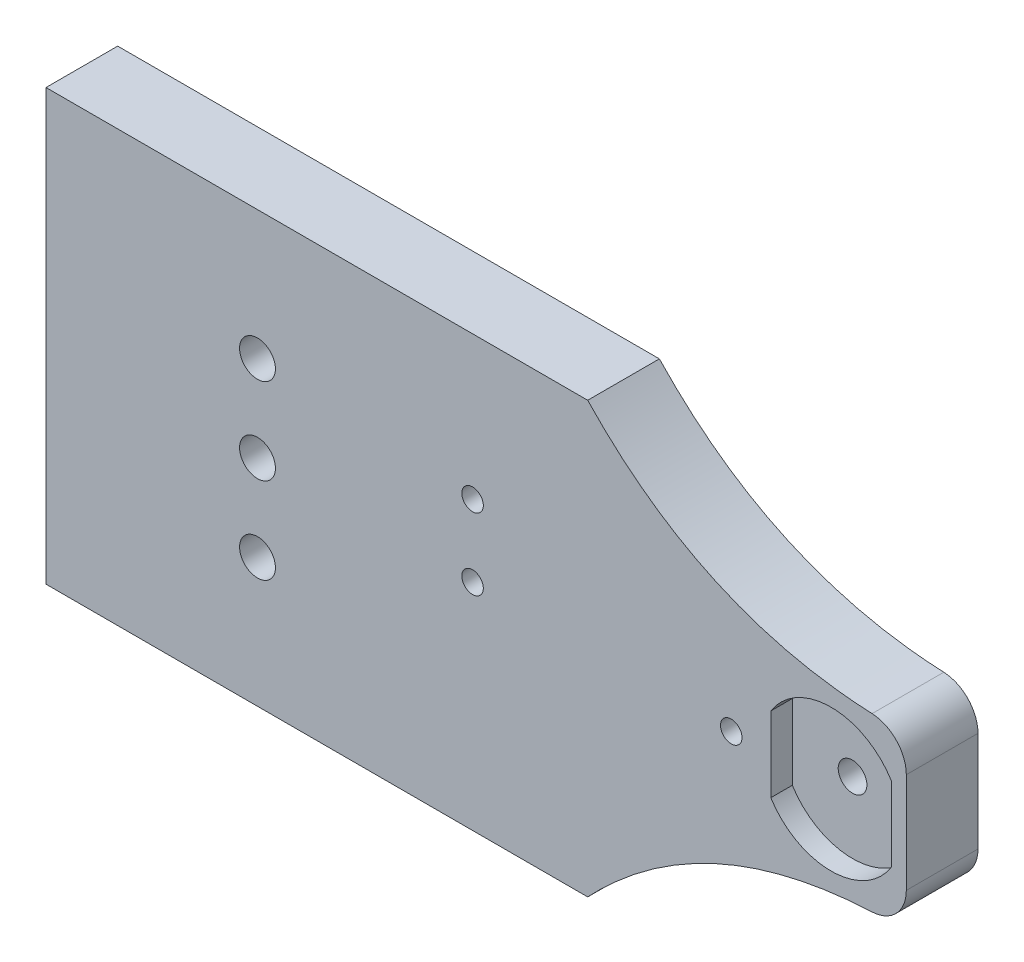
from build123d import *

# Parameters (mm, degrees)
ESQUISSE1_W                  = 120
ESQUISSE1_H                  = 60
BOSS_EXTRU_1_DEPTH           = 10
ESQUISSE2_R                  = 9.9
ENL_V_MAT_EXTRU_1_DEPTH      = 3
ENL_V_MAT_EXTRU_2_DEPTH      = 102.27612149
ENL_V_MAT_EXTRU_2_DEPTH_BACK = 102.27612149
ESQUISSE3_R                  = 2
ESQUISSE3_R_2                = 1.5
ESQUISSE3_R_3                = 2.5
ESQUISSE4_W                  = 2.1
ESQUISSE4_H                  = 32.729275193
ESQUISSE4_W_2                = 7.884914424
ESQUISSE4_H_2                = 34.938196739
BOSS_EXTRU_2_DEPTH           = 3
ENL_V_MAT_EXTRU_3_DEPTH      = 10
CONG_1_R                     = 5
ESQUISSE6_R                  = 1.5
ENL_V_MAT_EXTRU_4_DEPTH      = 10


with BuildPart() as part:
    # Esquisse1 → Boss.-Extru.1 (new body)
    with BuildSketch(Plane.XY):
        with Locations((-35.581599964, 1.953255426)):
            Rectangle(ESQUISSE1_W, ESQUISSE1_H)
    extrude(amount=BOSS_EXTRU_1_DEPTH)

    # Esquisse2 → Enl_v. mat.-Extru.1 (cut)
    with BuildSketch(Plane.XY.offset(10)):
        with Locations((13.918400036, 1.953255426)):
            Circle(ESQUISSE2_R)
    extrude(amount=-ENL_V_MAT_EXTRU_1_DEPTH, mode=Mode.SUBTRACT)

    # Esquisse3 → Enl_v. mat.-Extru.2 (cut, two sides: drawn at the far end of the back side and taken through both)
    with BuildSketch(Plane.XY.offset(-ENL_V_MAT_EXTRU_2_DEPTH_BACK)):
        with Locations((13.918400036, 1.953255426)):
            Circle(ESQUISSE3_R)
        with Locations((-36.081599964, 1.953255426)):
            Circle(ESQUISSE3_R_2)
        with Locations((-66.081599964, 1.953255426)):
            Circle(ESQUISSE3_R_3)
        with Locations((-66.081599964, 13.953255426)):
            Circle(ESQUISSE3_R_3)
        with Locations((-66.081599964, -10.046744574)):
            Circle(ESQUISSE3_R_3)
        with Locations((-36.081599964, 11.953255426)):
            Circle(ESQUISSE3_R_2)
    extrude(amount=ENL_V_MAT_EXTRU_2_DEPTH + ENL_V_MAT_EXTRU_2_DEPTH_BACK, mode=Mode.SUBTRACT)

    # Esquisse4 → Boss.-Extru.2 (add)
    with BuildSketch(Plane.XY.offset(10)):
        with Locations((23.368400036, 7.495656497)):
            Rectangle(ESQUISSE4_W, ESQUISSE4_H)
        with Locations((1.575942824, 3.487829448)):
            Rectangle(ESQUISSE4_W_2, ESQUISSE4_H_2)
    extrude(amount=-BOSS_EXTRU_2_DEPTH)

    # Esquisse5 → Enl_v. mat.-Extru.3 (cut)
    with BuildSketch(Plane.XY.offset(10)):
        with BuildLine():
            Line((-20.023088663, 31.953255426), (24.418400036, 31.953255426))
            Line((24.418400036, 31.953255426), (24.418400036, 13.877196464))
            add(Edge.make_bspline(
                [(24.418400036, 13.877196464), (-2.445436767, 13.32321573), (-20.023088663, 31.953255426)],
                knots=[0, 0, 0, 1, 1, 1], degree=2))
        make_face()
        with BuildLine():
            Line((-20.023088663, -28.046744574), (24.418400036, -28.046744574))
            Line((24.418400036, -28.046744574), (24.418400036, -9.970685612))
            add(Edge.make_bspline(
                [(24.418400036, -9.970685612), (-2.445436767, -9.416704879), (-20.023088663, -28.046744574)],
                knots=[0, 0, 0, 1, 1, 1], degree=2))
        make_face()
    extrude(amount=-ENL_V_MAT_EXTRU_3_DEPTH, mode=Mode.SUBTRACT)

    # Cong_1
    cong_1_edges = [part.edges().sort_by_distance(p)[0] for p in [
        (24.418400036, 13.877196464, 5),
        (24.418400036, -9.970685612, 5),
    ]]
    fillet(cong_1_edges, radius=CONG_1_R)

    # Esquisse6 → Enl_v. mat.-Extru.4 (cut)
    with BuildSketch(Plane.XY.offset(10)):
        with Locations((0, 1.953255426)):
            Circle(ESQUISSE6_R)
    extrude(amount=-ENL_V_MAT_EXTRU_4_DEPTH, mode=Mode.SUBTRACT)


solid = part.part
